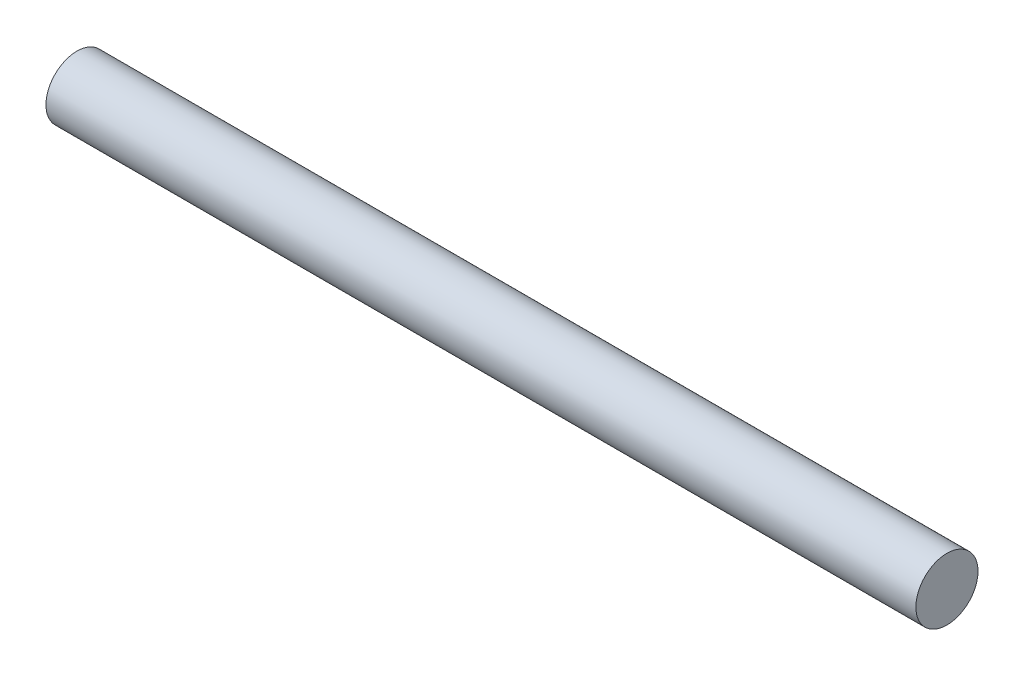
from build123d import *

# Parameters (mm, degrees)
SKETCH1_R           = 3.175
BOSS_EXTRUDE1_DEPTH = 44.45


with BuildPart() as part:
    # Sketch1 → Boss-Extrude1 (new, symmetric)
    with BuildSketch(Plane(origin=(0, 0, 0), x_dir=(0, 0, -1), z_dir=(1, 0, 0))):
        Circle(SKETCH1_R)
    extrude(amount=BOSS_EXTRUDE1_DEPTH, both=True)


solid = part.part
